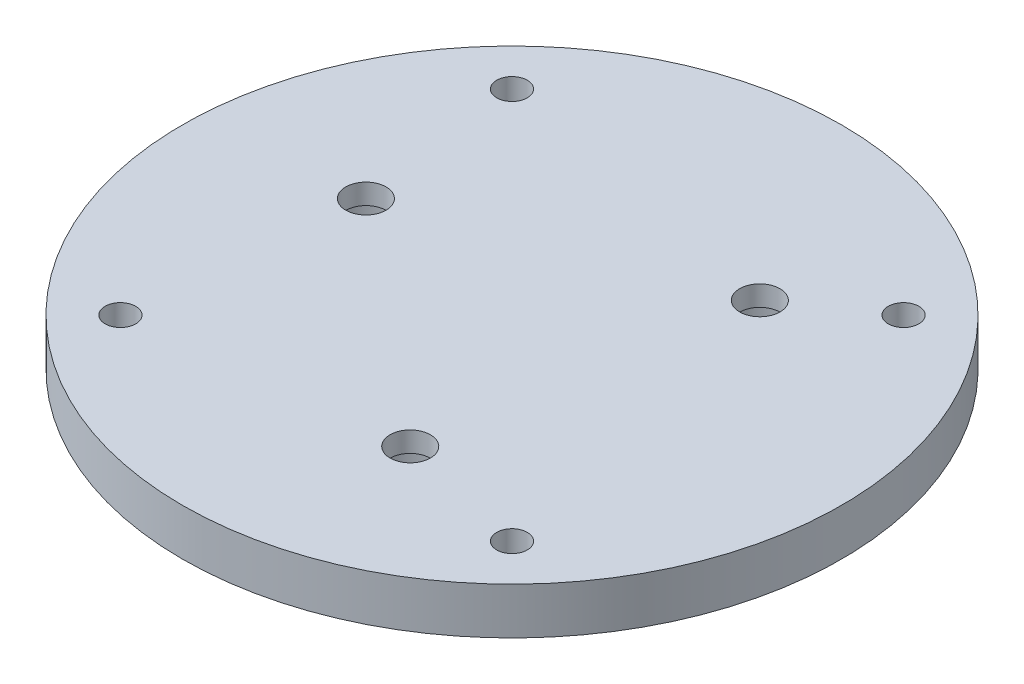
ISO-10303-21;
HEADER;
FILE_DESCRIPTION(('STEP AP214'),'2;1');
FILE_NAME('part.step','',(''),(''),'','','');
FILE_SCHEMA(('AUTOMOTIVE_DESIGN { 1 0 10303 214 1 1 1 1 }'));
ENDSEC;
DATA;
#1=APPLICATION_CONTEXT('core data for automotive mechanical design processes');
#2=APPLICATION_PROTOCOL_DEFINITION('international standard','automotive_design',2000,#1);
#3=PRODUCT_CONTEXT('',#1,'mechanical');
#4=PRODUCT('Part','Part','',(#3));
#5=PRODUCT_RELATED_PRODUCT_CATEGORY('part','',(#4));
#6=PRODUCT_DEFINITION_FORMATION('','',#4);
#7=PRODUCT_DEFINITION_CONTEXT('part definition',#1,'design');
#8=PRODUCT_DEFINITION('design','',#6,#7);
#9=PRODUCT_DEFINITION_SHAPE('','',#8);
#10=(LENGTH_UNIT() NAMED_UNIT(*) SI_UNIT(.MILLI.,.METRE.));
#11=(NAMED_UNIT(*) PLANE_ANGLE_UNIT() SI_UNIT($,.RADIAN.));
#12=(NAMED_UNIT(*) SI_UNIT($,.STERADIAN.) SOLID_ANGLE_UNIT());
#13=UNCERTAINTY_MEASURE_WITH_UNIT(LENGTH_MEASURE(1.E-05),#10,'distance_accuracy_value','');
#14=(GEOMETRIC_REPRESENTATION_CONTEXT(3) GLOBAL_UNCERTAINTY_ASSIGNED_CONTEXT((#13)) GLOBAL_UNIT_ASSIGNED_CONTEXT((#10,
#11,#12)) REPRESENTATION_CONTEXT('',''));
#15=CARTESIAN_POINT('',(0.,0.,0.));
#16=DIRECTION('',(0.,0.,1.));
#17=DIRECTION('',(1.,0.,0.));
#18=AXIS2_PLACEMENT_3D('',#15,#16,#17);
#19=CARTESIAN_POINT('',(0.,6.35,0.));
#20=DIRECTION('',(0.,-1.,0.));
#21=DIRECTION('',(0.,0.,-1.));
#22=AXIS2_PLACEMENT_3D('',#19,#20,#21);
#23=CYLINDRICAL_SURFACE('',#22,44.8945);
#24=CARTESIAN_POINT('',(0.,6.35,0.));
#25=DIRECTION('',(0.,1.,0.));
#26=DIRECTION('',(0.,0.,1.));
#27=AXIS2_PLACEMENT_3D('',#24,#25,#26);
#28=CIRCLE('',#27,44.8945);
#29=CARTESIAN_POINT('',(0.,6.35,44.8945));
#30=VERTEX_POINT('',#29);
#31=EDGE_CURVE('E10',#30,#30,#28,.T.);
#32=ORIENTED_EDGE('',*,*,#31,.F.);
#33=EDGE_LOOP('',(#32));
#34=FACE_BOUND('',#33,.T.);
#35=CARTESIAN_POINT('',(0.,0.,0.));
#36=DIRECTION('',(0.,1.,0.));
#37=DIRECTION('',(0.,0.,1.));
#38=AXIS2_PLACEMENT_3D('',#35,#36,#37);
#39=CIRCLE('',#38,44.8945);
#40=CARTESIAN_POINT('',(0.,0.,44.8945));
#41=VERTEX_POINT('',#40);
#42=EDGE_CURVE('E35',#41,#41,#39,.T.);
#43=ORIENTED_EDGE('',*,*,#42,.T.);
#44=EDGE_LOOP('',(#43));
#45=FACE_BOUND('',#44,.T.);
#46=ADVANCED_FACE('F32',(#34,#45),#23,.T.);
#47=CARTESIAN_POINT('',(0.,6.35,0.));
#48=DIRECTION('',(0.,1.,0.));
#49=DIRECTION('',(0.,0.,1.));
#50=AXIS2_PLACEMENT_3D('',#47,#48,#49);
#51=PLANE('',#50);
#52=CARTESIAN_POINT('',(15.1382985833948,6.35,-18.6234238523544));
#53=DIRECTION('',(0.,-1.,0.));
#54=DIRECTION('',(0.,0.,-1.));
#55=AXIS2_PLACEMENT_3D('',#52,#53,#54);
#56=CIRCLE('',#55,2.75);
#57=CARTESIAN_POINT('',(15.1382985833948,6.35,-21.3734238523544));
#58=VERTEX_POINT('',#57);
#59=EDGE_CURVE('E91',#58,#58,#56,.T.);
#60=ORIENTED_EDGE('',*,*,#59,.T.);
#61=EDGE_LOOP('',(#60));
#62=FACE_BOUND('',#61,.T.);
#63=CARTESIAN_POINT('',(8.55920886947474,6.35,22.4218630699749));
#64=DIRECTION('',(0.,-1.,0.));
#65=DIRECTION('',(0.,0.,-1.));
#66=AXIS2_PLACEMENT_3D('',#63,#64,#65);
#67=CIRCLE('',#66,2.75);
#68=CARTESIAN_POINT('',(8.55920886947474,6.35,19.6718630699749));
#69=VERTEX_POINT('',#68);
#70=EDGE_CURVE('E79',#69,#69,#67,.T.);
#71=ORIENTED_EDGE('',*,*,#70,.T.);
#72=EDGE_LOOP('',(#71));
#73=FACE_BOUND('',#72,.T.);
#74=CARTESIAN_POINT('',(-23.6975074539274,6.35,-3.79843921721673));
#75=DIRECTION('',(0.,-1.,0.));
#76=DIRECTION('',(0.,0.,-1.));
#77=AXIS2_PLACEMENT_3D('',#74,#75,#76);
#78=CIRCLE('',#77,2.75);
#79=CARTESIAN_POINT('',(-23.6975074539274,6.35,-6.54843921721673));
#80=VERTEX_POINT('',#79);
#81=EDGE_CURVE('E67',#80,#80,#78,.T.);
#82=ORIENTED_EDGE('',*,*,#81,.T.);
#83=EDGE_LOOP('',(#82));
#84=FACE_BOUND('',#83,.T.);
#85=CARTESIAN_POINT('',(-26.6700000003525,6.35,-26.6699999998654));
#86=DIRECTION('',(0.,1.,0.));
#87=DIRECTION('',(0.,0.,1.));
#88=AXIS2_PLACEMENT_3D('',#85,#86,#87);
#89=CIRCLE('',#88,2.0828);
#90=CARTESIAN_POINT('',(-26.6700000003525,6.35,-24.5871999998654));
#91=VERTEX_POINT('',#90);
#92=EDGE_CURVE('E64',#91,#91,#89,.T.);
#93=ORIENTED_EDGE('',*,*,#92,.F.);
#94=EDGE_LOOP('',(#93));
#95=FACE_BOUND('',#94,.T.);
#96=CARTESIAN_POINT('',(26.6699999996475,6.35,-26.6699999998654));
#97=DIRECTION('',(0.,1.,0.));
#98=DIRECTION('',(0.,0.,1.));
#99=AXIS2_PLACEMENT_3D('',#96,#97,#98);
#100=CIRCLE('',#99,2.0828);
#101=CARTESIAN_POINT('',(26.6699999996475,6.35,-24.5871999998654));
#102=VERTEX_POINT('',#101);
#103=EDGE_CURVE('E58',#102,#102,#100,.T.);
#104=ORIENTED_EDGE('',*,*,#103,.F.);
#105=EDGE_LOOP('',(#104));
#106=FACE_BOUND('',#105,.T.);
#107=CARTESIAN_POINT('',(-26.6700000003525,6.35,26.6700000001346));
#108=DIRECTION('',(0.,1.,0.));
#109=DIRECTION('',(0.,0.,1.));
#110=AXIS2_PLACEMENT_3D('',#107,#108,#109);
#111=CIRCLE('',#110,2.0828);
#112=CARTESIAN_POINT('',(-26.6700000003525,6.35,28.7528000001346));
#113=VERTEX_POINT('',#112);
#114=EDGE_CURVE('E52',#113,#113,#111,.T.);
#115=ORIENTED_EDGE('',*,*,#114,.F.);
#116=EDGE_LOOP('',(#115));
#117=FACE_BOUND('',#116,.T.);
#118=CARTESIAN_POINT('',(26.6699999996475,6.35,26.6700000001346));
#119=DIRECTION('',(0.,1.,0.));
#120=DIRECTION('',(0.,0.,1.));
#121=AXIS2_PLACEMENT_3D('',#118,#119,#120);
#122=CIRCLE('',#121,2.0828);
#123=CARTESIAN_POINT('',(26.6699999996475,6.35,28.7528000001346));
#124=VERTEX_POINT('',#123);
#125=EDGE_CURVE('E46',#124,#124,#122,.T.);
#126=ORIENTED_EDGE('',*,*,#125,.F.);
#127=EDGE_LOOP('',(#126));
#128=FACE_BOUND('',#127,.T.);
#129=ORIENTED_EDGE('',*,*,#31,.T.);
#130=EDGE_LOOP('',(#129));
#131=FACE_BOUND('',#130,.T.);
#132=ADVANCED_FACE('F110',(#62,#73,#84,#95,#106,#117,#128,#131),#51,.T.);
#133=CARTESIAN_POINT('',(0.,0.,0.));
#134=DIRECTION('',(0.,1.,0.));
#135=DIRECTION('',(0.,0.,1.));
#136=AXIS2_PLACEMENT_3D('',#133,#134,#135);
#137=PLANE('',#136);
#138=CARTESIAN_POINT('',(15.1382985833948,0.,-18.6234238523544));
#139=DIRECTION('',(0.,-1.,0.));
#140=DIRECTION('',(0.,0.,-1.));
#141=AXIS2_PLACEMENT_3D('',#138,#139,#140);
#142=CIRCLE('',#141,6.12);
#143=CARTESIAN_POINT('',(15.1382985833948,0.,-24.7434238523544));
#144=VERTEX_POINT('',#143);
#145=EDGE_CURVE('E100',#144,#144,#142,.T.);
#146=ORIENTED_EDGE('',*,*,#145,.F.);
#147=EDGE_LOOP('',(#146));
#148=FACE_BOUND('',#147,.T.);
#149=CARTESIAN_POINT('',(8.55920886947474,0.,22.4218630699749));
#150=DIRECTION('',(0.,-1.,0.));
#151=DIRECTION('',(0.,0.,-1.));
#152=AXIS2_PLACEMENT_3D('',#149,#150,#151);
#153=CIRCLE('',#152,6.12);
#154=CARTESIAN_POINT('',(8.55920886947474,0.,16.3018630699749));
#155=VERTEX_POINT('',#154);
#156=EDGE_CURVE('E88',#155,#155,#153,.T.);
#157=ORIENTED_EDGE('',*,*,#156,.F.);
#158=EDGE_LOOP('',(#157));
#159=FACE_BOUND('',#158,.T.);
#160=CARTESIAN_POINT('',(-23.6975074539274,0.,-3.79843921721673));
#161=DIRECTION('',(0.,-1.,0.));
#162=DIRECTION('',(0.,0.,-1.));
#163=AXIS2_PLACEMENT_3D('',#160,#161,#162);
#164=CIRCLE('',#163,6.12);
#165=CARTESIAN_POINT('',(-23.6975074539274,0.,-9.91843921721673));
#166=VERTEX_POINT('',#165);
#167=EDGE_CURVE('E76',#166,#166,#164,.T.);
#168=ORIENTED_EDGE('',*,*,#167,.F.);
#169=EDGE_LOOP('',(#168));
#170=FACE_BOUND('',#169,.T.);
#171=CARTESIAN_POINT('',(-26.6700000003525,0.,-26.6699999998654));
#172=DIRECTION('',(0.,1.,0.));
#173=DIRECTION('',(0.,0.,1.));
#174=AXIS2_PLACEMENT_3D('',#171,#172,#173);
#175=CIRCLE('',#174,2.0828);
#176=CARTESIAN_POINT('',(-26.6700000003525,0.,-24.5871999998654));
#177=VERTEX_POINT('',#176);
#178=EDGE_CURVE('E61',#177,#177,#175,.T.);
#179=ORIENTED_EDGE('',*,*,#178,.T.);
#180=EDGE_LOOP('',(#179));
#181=FACE_BOUND('',#180,.T.);
#182=CARTESIAN_POINT('',(26.6699999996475,0.,-26.6699999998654));
#183=DIRECTION('',(0.,1.,0.));
#184=DIRECTION('',(0.,0.,1.));
#185=AXIS2_PLACEMENT_3D('',#182,#183,#184);
#186=CIRCLE('',#185,2.0828);
#187=CARTESIAN_POINT('',(26.6699999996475,0.,-24.5871999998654));
#188=VERTEX_POINT('',#187);
#189=EDGE_CURVE('E55',#188,#188,#186,.T.);
#190=ORIENTED_EDGE('',*,*,#189,.T.);
#191=EDGE_LOOP('',(#190));
#192=FACE_BOUND('',#191,.T.);
#193=CARTESIAN_POINT('',(-26.6700000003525,0.,26.6700000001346));
#194=DIRECTION('',(0.,1.,0.));
#195=DIRECTION('',(0.,0.,1.));
#196=AXIS2_PLACEMENT_3D('',#193,#194,#195);
#197=CIRCLE('',#196,2.0828);
#198=CARTESIAN_POINT('',(-26.6700000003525,0.,28.7528000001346));
#199=VERTEX_POINT('',#198);
#200=EDGE_CURVE('E49',#199,#199,#197,.T.);
#201=ORIENTED_EDGE('',*,*,#200,.T.);
#202=EDGE_LOOP('',(#201));
#203=FACE_BOUND('',#202,.T.);
#204=CARTESIAN_POINT('',(26.6699999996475,0.,26.6700000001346));
#205=DIRECTION('',(0.,1.,0.));
#206=DIRECTION('',(0.,0.,1.));
#207=AXIS2_PLACEMENT_3D('',#204,#205,#206);
#208=CIRCLE('',#207,2.0828);
#209=CARTESIAN_POINT('',(26.6699999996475,0.,28.7528000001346));
#210=VERTEX_POINT('',#209);
#211=EDGE_CURVE('E42',#210,#210,#208,.T.);
#212=ORIENTED_EDGE('',*,*,#211,.T.);
#213=EDGE_LOOP('',(#212));
#214=FACE_BOUND('',#213,.T.);
#215=ORIENTED_EDGE('',*,*,#42,.F.);
#216=EDGE_LOOP('',(#215));
#217=FACE_BOUND('',#216,.T.);
#218=ADVANCED_FACE('F106',(#148,#159,#170,#181,#192,#203,#214,#217),#137,.F.);
#219=CARTESIAN_POINT('',(26.6699999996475,6.35,26.6700000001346));
#220=DIRECTION('',(0.,1.,0.));
#221=DIRECTION('',(0.,0.,1.));
#222=AXIS2_PLACEMENT_3D('',#219,#220,#221);
#223=CYLINDRICAL_SURFACE('',#222,2.0828);
#224=ORIENTED_EDGE('',*,*,#211,.F.);
#225=EDGE_LOOP('',(#224));
#226=FACE_BOUND('',#225,.T.);
#227=ORIENTED_EDGE('',*,*,#125,.T.);
#228=EDGE_LOOP('',(#227));
#229=FACE_BOUND('',#228,.T.);
#230=ADVANCED_FACE('F109',(#226,#229),#223,.F.);
#231=CARTESIAN_POINT('',(-26.6700000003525,6.35,26.6700000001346));
#232=DIRECTION('',(0.,1.,0.));
#233=DIRECTION('',(0.,0.,1.));
#234=AXIS2_PLACEMENT_3D('',#231,#232,#233);
#235=CYLINDRICAL_SURFACE('',#234,2.0828);
#236=ORIENTED_EDGE('',*,*,#200,.F.);
#237=EDGE_LOOP('',(#236));
#238=FACE_BOUND('',#237,.T.);
#239=ORIENTED_EDGE('',*,*,#114,.T.);
#240=EDGE_LOOP('',(#239));
#241=FACE_BOUND('',#240,.T.);
#242=ADVANCED_FACE('F138',(#238,#241),#235,.F.);
#243=CARTESIAN_POINT('',(26.6699999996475,6.35,-26.6699999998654));
#244=DIRECTION('',(0.,1.,0.));
#245=DIRECTION('',(0.,0.,1.));
#246=AXIS2_PLACEMENT_3D('',#243,#244,#245);
#247=CYLINDRICAL_SURFACE('',#246,2.0828);
#248=ORIENTED_EDGE('',*,*,#189,.F.);
#249=EDGE_LOOP('',(#248));
#250=FACE_BOUND('',#249,.T.);
#251=ORIENTED_EDGE('',*,*,#103,.T.);
#252=EDGE_LOOP('',(#251));
#253=FACE_BOUND('',#252,.T.);
#254=ADVANCED_FACE('F142',(#250,#253),#247,.F.);
#255=CARTESIAN_POINT('',(-26.6700000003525,6.35,-26.6699999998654));
#256=DIRECTION('',(0.,1.,0.));
#257=DIRECTION('',(0.,0.,1.));
#258=AXIS2_PLACEMENT_3D('',#255,#256,#257);
#259=CYLINDRICAL_SURFACE('',#258,2.0828);
#260=ORIENTED_EDGE('',*,*,#178,.F.);
#261=EDGE_LOOP('',(#260));
#262=FACE_BOUND('',#261,.T.);
#263=ORIENTED_EDGE('',*,*,#92,.T.);
#264=EDGE_LOOP('',(#263));
#265=FACE_BOUND('',#264,.T.);
#266=ADVANCED_FACE('F146',(#262,#265),#259,.F.);
#267=CARTESIAN_POINT('',(-23.6975074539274,0.,-3.79843921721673));
#268=DIRECTION('',(0.,-1.,0.));
#269=DIRECTION('',(0.,0.,-1.));
#270=AXIS2_PLACEMENT_3D('',#267,#268,#269);
#271=CYLINDRICAL_SURFACE('',#270,2.75);
#272=ORIENTED_EDGE('',*,*,#81,.F.);
#273=EDGE_LOOP('',(#272));
#274=FACE_BOUND('',#273,.T.);
#275=CARTESIAN_POINT('',(-23.6975074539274,3.58,-3.79843921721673));
#276=DIRECTION('',(0.,-1.,0.));
#277=DIRECTION('',(0.,0.,-1.));
#278=AXIS2_PLACEMENT_3D('',#275,#276,#277);
#279=CIRCLE('',#278,2.75);
#280=CARTESIAN_POINT('',(-23.6975074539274,3.58,-6.54843921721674));
#281=VERTEX_POINT('',#280);
#282=EDGE_CURVE('E70',#281,#281,#279,.T.);
#283=ORIENTED_EDGE('',*,*,#282,.T.);
#284=EDGE_LOOP('',(#283));
#285=FACE_BOUND('',#284,.T.);
#286=ADVANCED_FACE('F150',(#274,#285),#271,.F.);
#287=CARTESIAN_POINT('',(-20.9475074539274,3.58,-3.79843921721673));
#288=DIRECTION('',(0.,1.,0.));
#289=DIRECTION('',(0.,0.,1.));
#290=AXIS2_PLACEMENT_3D('',#287,#288,#289);
#291=PLANE('',#290);
#292=ORIENTED_EDGE('',*,*,#282,.F.);
#293=EDGE_LOOP('',(#292));
#294=FACE_BOUND('',#293,.T.);
#295=CARTESIAN_POINT('',(-23.6975074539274,3.58,-3.79843921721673));
#296=DIRECTION('',(0.,-1.,0.));
#297=DIRECTION('',(0.,0.,-1.));
#298=AXIS2_PLACEMENT_3D('',#295,#296,#297);
#299=CIRCLE('',#298,6.12);
#300=CARTESIAN_POINT('',(-23.6975074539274,3.58,-9.91843921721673));
#301=VERTEX_POINT('',#300);
#302=EDGE_CURVE('E73',#301,#301,#299,.T.);
#303=ORIENTED_EDGE('',*,*,#302,.T.);
#304=EDGE_LOOP('',(#303));
#305=FACE_BOUND('',#304,.T.);
#306=ADVANCED_FACE('F154',(#294,#305),#291,.F.);
#307=CARTESIAN_POINT('',(-23.6975074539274,0.,-3.79843921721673));
#308=DIRECTION('',(0.,-1.,0.));
#309=DIRECTION('',(0.,0.,-1.));
#310=AXIS2_PLACEMENT_3D('',#307,#308,#309);
#311=CYLINDRICAL_SURFACE('',#310,6.12);
#312=ORIENTED_EDGE('',*,*,#302,.F.);
#313=EDGE_LOOP('',(#312));
#314=FACE_BOUND('',#313,.T.);
#315=ORIENTED_EDGE('',*,*,#167,.T.);
#316=EDGE_LOOP('',(#315));
#317=FACE_BOUND('',#316,.T.);
#318=ADVANCED_FACE('F158',(#314,#317),#311,.F.);
#319=CARTESIAN_POINT('',(8.55920886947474,0.,22.4218630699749));
#320=DIRECTION('',(0.,-1.,0.));
#321=DIRECTION('',(0.,0.,-1.));
#322=AXIS2_PLACEMENT_3D('',#319,#320,#321);
#323=CYLINDRICAL_SURFACE('',#322,2.75);
#324=ORIENTED_EDGE('',*,*,#70,.F.);
#325=EDGE_LOOP('',(#324));
#326=FACE_BOUND('',#325,.T.);
#327=CARTESIAN_POINT('',(8.55920886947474,3.58,22.4218630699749));
#328=DIRECTION('',(0.,-1.,0.));
#329=DIRECTION('',(0.,0.,-1.));
#330=AXIS2_PLACEMENT_3D('',#327,#328,#329);
#331=CIRCLE('',#330,2.75);
#332=CARTESIAN_POINT('',(8.55920886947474,3.58,19.6718630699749));
#333=VERTEX_POINT('',#332);
#334=EDGE_CURVE('E82',#333,#333,#331,.T.);
#335=ORIENTED_EDGE('',*,*,#334,.T.);
#336=EDGE_LOOP('',(#335));
#337=FACE_BOUND('',#336,.T.);
#338=ADVANCED_FACE('F162',(#326,#337),#323,.F.);
#339=CARTESIAN_POINT('',(11.3092088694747,3.58,22.4218630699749));
#340=DIRECTION('',(0.,1.,0.));
#341=DIRECTION('',(0.,0.,1.));
#342=AXIS2_PLACEMENT_3D('',#339,#340,#341);
#343=PLANE('',#342);
#344=ORIENTED_EDGE('',*,*,#334,.F.);
#345=EDGE_LOOP('',(#344));
#346=FACE_BOUND('',#345,.T.);
#347=CARTESIAN_POINT('',(8.55920886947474,3.58,22.4218630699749));
#348=DIRECTION('',(0.,-1.,0.));
#349=DIRECTION('',(0.,0.,-1.));
#350=AXIS2_PLACEMENT_3D('',#347,#348,#349);
#351=CIRCLE('',#350,6.12);
#352=CARTESIAN_POINT('',(8.55920886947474,3.58,16.3018630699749));
#353=VERTEX_POINT('',#352);
#354=EDGE_CURVE('E85',#353,#353,#351,.T.);
#355=ORIENTED_EDGE('',*,*,#354,.T.);
#356=EDGE_LOOP('',(#355));
#357=FACE_BOUND('',#356,.T.);
#358=ADVANCED_FACE('F166',(#346,#357),#343,.F.);
#359=CARTESIAN_POINT('',(8.55920886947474,0.,22.4218630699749));
#360=DIRECTION('',(0.,-1.,0.));
#361=DIRECTION('',(0.,0.,-1.));
#362=AXIS2_PLACEMENT_3D('',#359,#360,#361);
#363=CYLINDRICAL_SURFACE('',#362,6.12);
#364=ORIENTED_EDGE('',*,*,#354,.F.);
#365=EDGE_LOOP('',(#364));
#366=FACE_BOUND('',#365,.T.);
#367=ORIENTED_EDGE('',*,*,#156,.T.);
#368=EDGE_LOOP('',(#367));
#369=FACE_BOUND('',#368,.T.);
#370=ADVANCED_FACE('F170',(#366,#369),#363,.F.);
#371=CARTESIAN_POINT('',(15.1382985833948,0.,-18.6234238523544));
#372=DIRECTION('',(0.,-1.,0.));
#373=DIRECTION('',(0.,0.,-1.));
#374=AXIS2_PLACEMENT_3D('',#371,#372,#373);
#375=CYLINDRICAL_SURFACE('',#374,2.75);
#376=ORIENTED_EDGE('',*,*,#59,.F.);
#377=EDGE_LOOP('',(#376));
#378=FACE_BOUND('',#377,.T.);
#379=CARTESIAN_POINT('',(15.1382985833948,3.58,-18.6234238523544));
#380=DIRECTION('',(0.,-1.,0.));
#381=DIRECTION('',(0.,0.,-1.));
#382=AXIS2_PLACEMENT_3D('',#379,#380,#381);
#383=CIRCLE('',#382,2.75);
#384=CARTESIAN_POINT('',(15.1382985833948,3.58,-21.3734238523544));
#385=VERTEX_POINT('',#384);
#386=EDGE_CURVE('E94',#385,#385,#383,.T.);
#387=ORIENTED_EDGE('',*,*,#386,.T.);
#388=EDGE_LOOP('',(#387));
#389=FACE_BOUND('',#388,.T.);
#390=ADVANCED_FACE('F174',(#378,#389),#375,.F.);
#391=CARTESIAN_POINT('',(17.8882985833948,3.58,-18.6234238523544));
#392=DIRECTION('',(0.,1.,0.));
#393=DIRECTION('',(0.,0.,1.));
#394=AXIS2_PLACEMENT_3D('',#391,#392,#393);
#395=PLANE('',#394);
#396=ORIENTED_EDGE('',*,*,#386,.F.);
#397=EDGE_LOOP('',(#396));
#398=FACE_BOUND('',#397,.T.);
#399=CARTESIAN_POINT('',(15.1382985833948,3.58,-18.6234238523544));
#400=DIRECTION('',(0.,-1.,0.));
#401=DIRECTION('',(0.,0.,-1.));
#402=AXIS2_PLACEMENT_3D('',#399,#400,#401);
#403=CIRCLE('',#402,6.12);
#404=CARTESIAN_POINT('',(15.1382985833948,3.58,-24.7434238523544));
#405=VERTEX_POINT('',#404);
#406=EDGE_CURVE('E97',#405,#405,#403,.T.);
#407=ORIENTED_EDGE('',*,*,#406,.T.);
#408=EDGE_LOOP('',(#407));
#409=FACE_BOUND('',#408,.T.);
#410=ADVANCED_FACE('F178',(#398,#409),#395,.F.);
#411=CARTESIAN_POINT('',(15.1382985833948,0.,-18.6234238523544));
#412=DIRECTION('',(0.,-1.,0.));
#413=DIRECTION('',(0.,0.,-1.));
#414=AXIS2_PLACEMENT_3D('',#411,#412,#413);
#415=CYLINDRICAL_SURFACE('',#414,6.12);
#416=ORIENTED_EDGE('',*,*,#406,.F.);
#417=EDGE_LOOP('',(#416));
#418=FACE_BOUND('',#417,.T.);
#419=ORIENTED_EDGE('',*,*,#145,.T.);
#420=EDGE_LOOP('',(#419));
#421=FACE_BOUND('',#420,.T.);
#422=ADVANCED_FACE('F104',(#418,#421),#415,.F.);
#423=CLOSED_SHELL('',(#46,#132,#218,#230,#242,#254,#266,#286,#306,#318,#338,#358,#370,#390,#410,#422));
#424=MANIFOLD_SOLID_BREP('B2',#423);
#425=ADVANCED_BREP_SHAPE_REPRESENTATION('',(#18,#424),#14);
#426=SHAPE_DEFINITION_REPRESENTATION(#9,#425);
ENDSEC;
END-ISO-10303-21;
